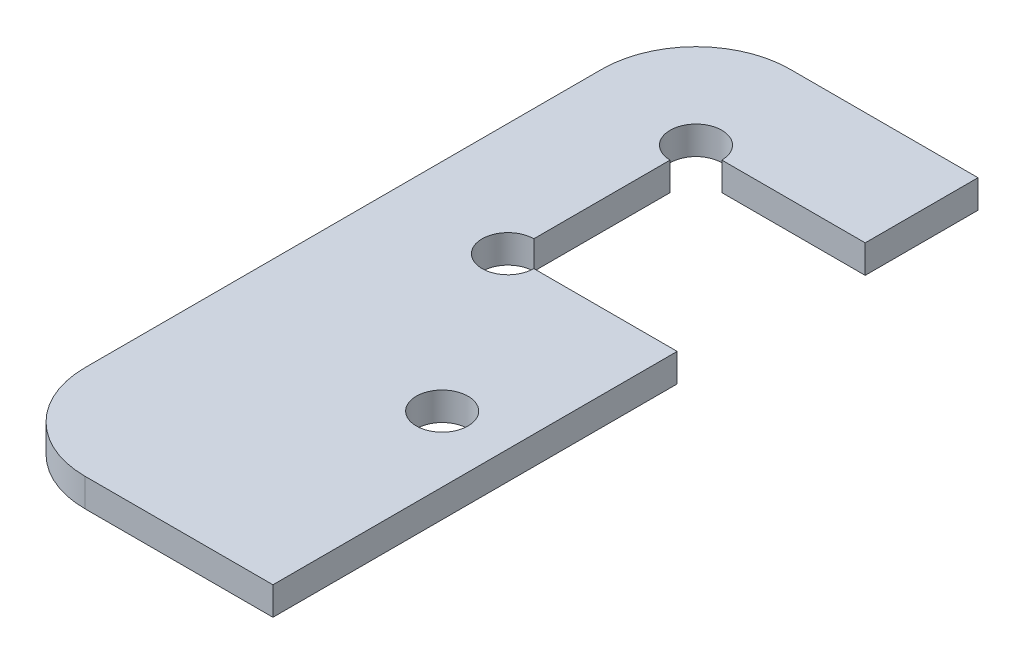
from build123d import *

# Parameters (mm, degrees)
SKETCH1_R      = 2.75
EXTRUDE1_DEPTH = 3


with BuildPart() as part:
    # Sketch1 → Extrude1 (new body)
    with BuildSketch(Plane(origin=(0, 0, 0), x_dir=(1, 0, 0), z_dir=(0, 1, 0))):
        with BuildLine():
            Line((10, 0), (30, 0))
            Line((30, 0), (30, 43))
            Line((30, 43), (14.75, 43))
            ThreePointArc((14.75, 43), (10.055456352, 41.055456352), (12, 45.75))
            Line((12, 45.75), (12, 60.25))
            ThreePointArc((12, 60.25), (10.055456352, 64.944543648), (14.75, 63))
            Line((14.75, 63), (30, 63))
            Line((30, 63), (30, 75))
            Line((30, 75), (10, 75))
            ThreePointArc((10, 75), (2.928932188, 72.071067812), (0, 65))
            Line((0, 65), (0, 10))
            ThreePointArc((0, 10), (2.928932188, 2.928932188), (10, 0))
        make_face()
        with Locations(Location((23, 25, 0), (0, 0, 270))):
            Circle(SKETCH1_R, mode=Mode.SUBTRACT)
    extrude(amount=EXTRUDE1_DEPTH)


solid = part.part
